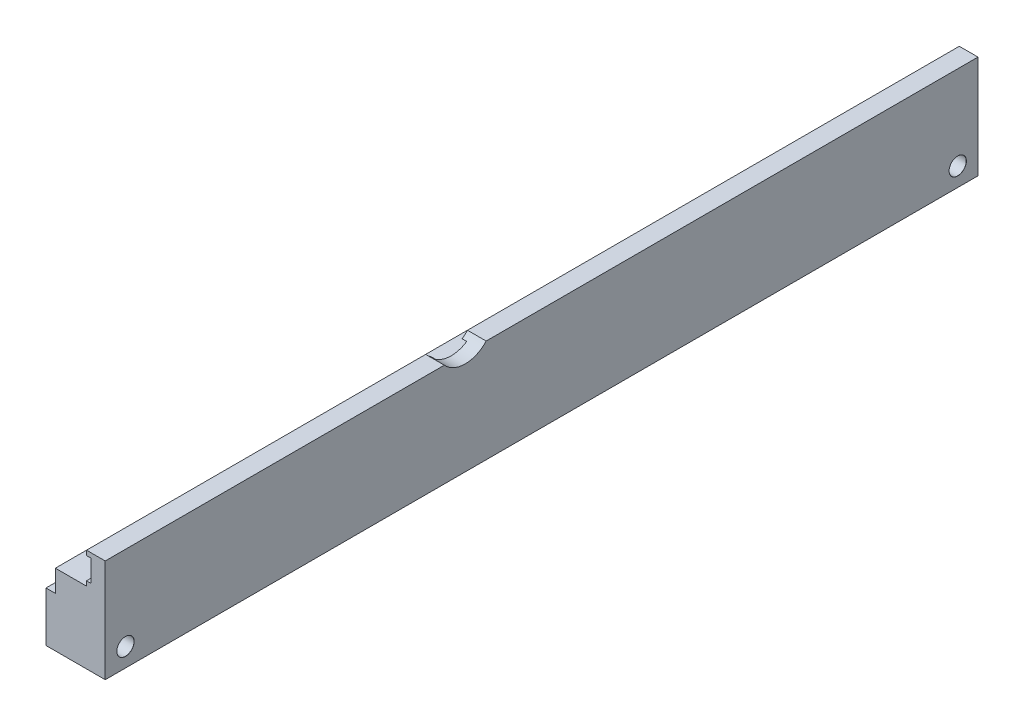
ISO-10303-21;
HEADER;
FILE_DESCRIPTION(('STEP AP214'),'2;1');
FILE_NAME('part.step','',(''),(''),'','','');
FILE_SCHEMA(('AUTOMOTIVE_DESIGN { 1 0 10303 214 1 1 1 1 }'));
ENDSEC;
DATA;
#1=APPLICATION_CONTEXT('core data for automotive mechanical design processes');
#2=APPLICATION_PROTOCOL_DEFINITION('international standard','automotive_design',2000,#1);
#3=PRODUCT_CONTEXT('',#1,'mechanical');
#4=PRODUCT('Part','Part','',(#3));
#5=PRODUCT_RELATED_PRODUCT_CATEGORY('part','',(#4));
#6=PRODUCT_DEFINITION_FORMATION('','',#4);
#7=PRODUCT_DEFINITION_CONTEXT('part definition',#1,'design');
#8=PRODUCT_DEFINITION('design','',#6,#7);
#9=PRODUCT_DEFINITION_SHAPE('','',#8);
#10=(LENGTH_UNIT() NAMED_UNIT(*) SI_UNIT(.MILLI.,.METRE.));
#11=(NAMED_UNIT(*) PLANE_ANGLE_UNIT() SI_UNIT($,.RADIAN.));
#12=(NAMED_UNIT(*) SI_UNIT($,.STERADIAN.) SOLID_ANGLE_UNIT());
#13=UNCERTAINTY_MEASURE_WITH_UNIT(LENGTH_MEASURE(1.E-05),#10,'distance_accuracy_value','');
#14=(GEOMETRIC_REPRESENTATION_CONTEXT(3) GLOBAL_UNCERTAINTY_ASSIGNED_CONTEXT((#13)) GLOBAL_UNIT_ASSIGNED_CONTEXT((#10,
#11,#12)) REPRESENTATION_CONTEXT('',''));
#15=CARTESIAN_POINT('',(0.,0.,0.));
#16=DIRECTION('',(0.,0.,1.));
#17=DIRECTION('',(1.,0.,0.));
#18=AXIS2_PLACEMENT_3D('',#15,#16,#17);
#19=CARTESIAN_POINT('',(-159.,251.054588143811,280.));
#20=DIRECTION('',(0.,-1.,0.));
#21=DIRECTION('',(0.,0.,-1.));
#22=AXIS2_PLACEMENT_3D('',#19,#20,#21);
#23=PLANE('',#22);
#24=DIRECTION('',(0.,0.,-1.));
#25=VECTOR('',#24,1.);
#26=CARTESIAN_POINT('',(-165.,251.054588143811,280.));
#27=LINE('',#26,#25);
#28=CARTESIAN_POINT('',(-165.,251.054588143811,157.791796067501));
#29=VERTEX_POINT('',#28);
#30=CARTESIAN_POINT('',(-165.,251.054588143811,0.));
#31=VERTEX_POINT('',#30);
#32=EDGE_CURVE('E157',#29,#31,#27,.T.);
#33=ORIENTED_EDGE('',*,*,#32,.F.);
#34=DIRECTION('',(1.,0.,0.));
#35=VECTOR('',#34,1.);
#36=CARTESIAN_POINT('',(-178.,251.054588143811,157.791796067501));
#37=LINE('',#36,#35);
#38=CARTESIAN_POINT('',(-159.,251.054588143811,157.791796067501));
#39=VERTEX_POINT('',#38);
#40=EDGE_CURVE('E245',#29,#39,#37,.T.);
#41=ORIENTED_EDGE('',*,*,#40,.T.);
#42=DIRECTION('',(0.,0.,-1.));
#43=VECTOR('',#42,1.);
#44=CARTESIAN_POINT('',(-159.,251.054588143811,280.));
#45=LINE('',#44,#43);
#46=CARTESIAN_POINT('',(-159.,251.054588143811,0.));
#47=VERTEX_POINT('',#46);
#48=EDGE_CURVE('E146',#39,#47,#45,.T.);
#49=ORIENTED_EDGE('',*,*,#48,.T.);
#50=DIRECTION('',(-1.,0.,0.));
#51=VECTOR('',#50,1.);
#52=CARTESIAN_POINT('',(-159.,251.054588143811,0.));
#53=LINE('',#52,#51);
#54=EDGE_CURVE('E173',#47,#31,#53,.T.);
#55=ORIENTED_EDGE('',*,*,#54,.T.);
#56=EDGE_LOOP('',(#33,#41,#49,#55));
#57=FACE_BOUND('',#56,.T.);
#58=ADVANCED_FACE('F16',(#57),#23,.F.);
#59=CARTESIAN_POINT('',(-165.,251.054588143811,280.));
#60=DIRECTION('',(1.,0.,0.));
#61=DIRECTION('',(0.,0.,-1.));
#62=AXIS2_PLACEMENT_3D('',#59,#60,#61);
#63=PLANE('',#62);
#64=CARTESIAN_POINT('',(-165.,251.054588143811,280.));
#65=VERTEX_POINT('',#64);
#66=CARTESIAN_POINT('',(-165.,251.054588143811,171.208203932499));
#67=VERTEX_POINT('',#66);
#68=EDGE_CURVE('E154',#65,#67,#27,.T.);
#69=ORIENTED_EDGE('',*,*,#68,.T.);
#70=CARTESIAN_POINT('',(-165.,257.054588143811,164.5));
#71=DIRECTION('',(1.,0.,0.));
#72=DIRECTION('',(0.,0.,-1.));
#73=AXIS2_PLACEMENT_3D('',#70,#71,#72);
#74=CIRCLE('',#73,9.);
#75=CARTESIAN_POINT('',(-165.,249.55458814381,169.474937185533));
#76=VERTEX_POINT('',#75);
#77=EDGE_CURVE('E133',#67,#76,#74,.T.);
#78=ORIENTED_EDGE('',*,*,#77,.T.);
#79=DIRECTION('',(0.,0.,-1.));
#80=VECTOR('',#79,1.);
#81=CARTESIAN_POINT('',(-165.,249.55458814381,280.));
#82=LINE('',#81,#80);
#83=CARTESIAN_POINT('',(-165.,249.55458814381,280.));
#84=VERTEX_POINT('',#83);
#85=EDGE_CURVE('E187',#84,#76,#82,.T.);
#86=ORIENTED_EDGE('',*,*,#85,.F.);
#87=DIRECTION('',(0.,-1.,0.));
#88=VECTOR('',#87,1.);
#89=CARTESIAN_POINT('',(-165.,251.054588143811,280.));
#90=LINE('',#89,#88);
#91=EDGE_CURVE('E182',#65,#84,#90,.T.);
#92=ORIENTED_EDGE('',*,*,#91,.F.);
#93=EDGE_LOOP('',(#69,#78,#86,#92));
#94=FACE_BOUND('',#93,.T.);
#95=ADVANCED_FACE('F360',(#94),#63,.F.);
#96=CARTESIAN_POINT('',(-163.5,249.55458814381,280.));
#97=DIRECTION('',(0.,1.,0.));
#98=DIRECTION('',(0.,0.,1.));
#99=AXIS2_PLACEMENT_3D('',#96,#97,#98);
#100=PLANE('',#99);
#101=ORIENTED_EDGE('',*,*,#85,.T.);
#102=DIRECTION('',(1.,0.,0.));
#103=VECTOR('',#102,1.);
#104=CARTESIAN_POINT('',(-178.,249.55458814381,169.474937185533));
#105=LINE('',#104,#103);
#106=CARTESIAN_POINT('',(-163.5,249.55458814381,169.474937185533));
#107=VERTEX_POINT('',#106);
#108=EDGE_CURVE('E11',#76,#107,#105,.T.);
#109=ORIENTED_EDGE('',*,*,#108,.T.);
#110=DIRECTION('',(0.,0.,-1.));
#111=VECTOR('',#110,1.);
#112=CARTESIAN_POINT('',(-163.5,249.55458814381,280.));
#113=LINE('',#112,#111);
#114=CARTESIAN_POINT('',(-163.5,249.55458814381,280.));
#115=VERTEX_POINT('',#114);
#116=EDGE_CURVE('E192',#115,#107,#113,.T.);
#117=ORIENTED_EDGE('',*,*,#116,.F.);
#118=DIRECTION('',(1.,0.,0.));
#119=VECTOR('',#118,1.);
#120=CARTESIAN_POINT('',(-163.5,249.55458814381,280.));
#121=LINE('',#120,#119);
#122=EDGE_CURVE('E203',#84,#115,#121,.T.);
#123=ORIENTED_EDGE('',*,*,#122,.F.);
#124=EDGE_LOOP('',(#101,#109,#117,#123));
#125=FACE_BOUND('',#124,.T.);
#126=ADVANCED_FACE('F362',(#125),#100,.F.);
#127=CARTESIAN_POINT('',(-159.,218.05458814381,280.));
#128=DIRECTION('',(-1.,0.,0.));
#129=DIRECTION('',(0.,0.,1.));
#130=AXIS2_PLACEMENT_3D('',#127,#128,#129);
#131=PLANE('',#130);
#132=CARTESIAN_POINT('',(-159.,224.05458814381,6.5));
#133=DIRECTION('',(-1.,0.,0.));
#134=DIRECTION('',(0.,0.,1.));
#135=AXIS2_PLACEMENT_3D('',#132,#133,#134);
#136=CIRCLE('',#135,2.775);
#137=CARTESIAN_POINT('',(-159.,224.05458814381,9.275));
#138=VERTEX_POINT('',#137);
#139=EDGE_CURVE('E288',#138,#138,#136,.T.);
#140=ORIENTED_EDGE('',*,*,#139,.T.);
#141=EDGE_LOOP('',(#140));
#142=FACE_BOUND('',#141,.T.);
#143=CARTESIAN_POINT('',(-159.,224.05458814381,273.5));
#144=DIRECTION('',(-1.,0.,0.));
#145=DIRECTION('',(0.,0.,1.));
#146=AXIS2_PLACEMENT_3D('',#143,#144,#145);
#147=CIRCLE('',#146,2.775);
#148=CARTESIAN_POINT('',(-159.,224.05458814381,276.275));
#149=VERTEX_POINT('',#148);
#150=EDGE_CURVE('E267',#149,#149,#147,.T.);
#151=ORIENTED_EDGE('',*,*,#150,.T.);
#152=EDGE_LOOP('',(#151));
#153=FACE_BOUND('',#152,.T.);
#154=ORIENTED_EDGE('',*,*,#48,.F.);
#155=CARTESIAN_POINT('',(-159.,257.054588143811,164.5));
#156=DIRECTION('',(1.,0.,0.));
#157=DIRECTION('',(0.,0.,-1.));
#158=AXIS2_PLACEMENT_3D('',#155,#156,#157);
#159=CIRCLE('',#158,9.);
#160=CARTESIAN_POINT('',(-159.,251.054588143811,171.208203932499));
#161=VERTEX_POINT('',#160);
#162=EDGE_CURVE('E130',#161,#39,#159,.T.);
#163=ORIENTED_EDGE('',*,*,#162,.F.);
#164=CARTESIAN_POINT('',(-159.,251.054588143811,280.));
#165=VERTEX_POINT('',#164);
#166=EDGE_CURVE('E144',#165,#161,#45,.T.);
#167=ORIENTED_EDGE('',*,*,#166,.F.);
#168=DIRECTION('',(0.,1.,0.));
#169=VECTOR('',#168,1.);
#170=CARTESIAN_POINT('',(-159.,218.05458814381,280.));
#171=LINE('',#170,#169);
#172=CARTESIAN_POINT('',(-159.,218.05458814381,280.));
#173=VERTEX_POINT('',#172);
#174=EDGE_CURVE('E167',#173,#165,#171,.T.);
#175=ORIENTED_EDGE('',*,*,#174,.F.);
#176=DIRECTION('',(0.,0.,-1.));
#177=VECTOR('',#176,1.);
#178=CARTESIAN_POINT('',(-159.,218.05458814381,280.));
#179=LINE('',#178,#177);
#180=CARTESIAN_POINT('',(-159.,218.05458814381,0.));
#181=VERTEX_POINT('',#180);
#182=EDGE_CURVE('E161',#173,#181,#179,.T.);
#183=ORIENTED_EDGE('',*,*,#182,.T.);
#184=DIRECTION('',(0.,1.,0.));
#185=VECTOR('',#184,1.);
#186=CARTESIAN_POINT('',(-159.,218.05458814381,0.));
#187=LINE('',#186,#185);
#188=EDGE_CURVE('E176',#181,#47,#187,.T.);
#189=ORIENTED_EDGE('',*,*,#188,.T.);
#190=EDGE_LOOP('',(#154,#163,#167,#175,#183,#189));
#191=FACE_BOUND('',#190,.T.);
#192=ADVANCED_FACE('F18',(#142,#153,#191),#131,.F.);
#193=ORIENTED_EDGE('',*,*,#166,.T.);
#194=DIRECTION('',(1.,0.,0.));
#195=VECTOR('',#194,1.);
#196=CARTESIAN_POINT('',(-178.,251.054588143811,171.208203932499));
#197=LINE('',#196,#195);
#198=EDGE_CURVE('E127',#161,#67,#197,.F.);
#199=ORIENTED_EDGE('',*,*,#198,.T.);
#200=ORIENTED_EDGE('',*,*,#68,.F.);
#201=DIRECTION('',(-1.,0.,0.));
#202=VECTOR('',#201,1.);
#203=CARTESIAN_POINT('',(-159.,251.054588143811,280.));
#204=LINE('',#203,#202);
#205=EDGE_CURVE('E151',#165,#65,#204,.T.);
#206=ORIENTED_EDGE('',*,*,#205,.F.);
#207=EDGE_LOOP('',(#193,#199,#200,#206));
#208=FACE_BOUND('',#207,.T.);
#209=ADVANCED_FACE('F150',(#208),#23,.F.);
#210=CARTESIAN_POINT('',(-165.,249.55458814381,159.525062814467));
#211=VERTEX_POINT('',#210);
#212=CARTESIAN_POINT('',(-165.,249.55458814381,0.));
#213=VERTEX_POINT('',#212);
#214=EDGE_CURVE('E191',#211,#213,#82,.T.);
#215=ORIENTED_EDGE('',*,*,#214,.F.);
#216=EDGE_CURVE('E31',#211,#29,#74,.T.);
#217=ORIENTED_EDGE('',*,*,#216,.T.);
#218=ORIENTED_EDGE('',*,*,#32,.T.);
#219=DIRECTION('',(0.,-1.,0.));
#220=VECTOR('',#219,1.);
#221=CARTESIAN_POINT('',(-165.,251.054588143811,0.));
#222=LINE('',#221,#220);
#223=EDGE_CURVE('E170',#31,#213,#222,.T.);
#224=ORIENTED_EDGE('',*,*,#223,.T.);
#225=EDGE_LOOP('',(#215,#217,#218,#224));
#226=FACE_BOUND('',#225,.T.);
#227=ADVANCED_FACE('F335',(#226),#63,.F.);
#228=CARTESIAN_POINT('',(-178.,218.05458814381,280.));
#229=DIRECTION('',(1.,0.,0.));
#230=DIRECTION('',(0.,0.,-1.));
#231=AXIS2_PLACEMENT_3D('',#228,#229,#230);
#232=PLANE('',#231);
#233=CARTESIAN_POINT('',(-178.,224.05458814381,6.5));
#234=DIRECTION('',(-1.,0.,0.));
#235=DIRECTION('',(0.,0.,1.));
#236=AXIS2_PLACEMENT_3D('',#233,#234,#235);
#237=CIRCLE('',#236,5.025);
#238=CARTESIAN_POINT('',(-178.,224.05458814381,11.525));
#239=VERTEX_POINT('',#238);
#240=EDGE_CURVE('E285',#239,#239,#237,.T.);
#241=ORIENTED_EDGE('',*,*,#240,.F.);
#242=EDGE_LOOP('',(#241));
#243=FACE_BOUND('',#242,.T.);
#244=CARTESIAN_POINT('',(-178.,224.05458814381,273.5));
#245=DIRECTION('',(-1.,0.,0.));
#246=DIRECTION('',(0.,0.,1.));
#247=AXIS2_PLACEMENT_3D('',#244,#245,#246);
#248=CIRCLE('',#247,5.025);
#249=CARTESIAN_POINT('',(-178.,224.05458814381,278.525));
#250=VERTEX_POINT('',#249);
#251=EDGE_CURVE('E264',#250,#250,#248,.T.);
#252=ORIENTED_EDGE('',*,*,#251,.F.);
#253=EDGE_LOOP('',(#252));
#254=FACE_BOUND('',#253,.T.);
#255=DIRECTION('',(0.,-1.,0.));
#256=VECTOR('',#255,1.);
#257=CARTESIAN_POINT('',(-178.,218.05458814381,280.));
#258=LINE('',#257,#256);
#259=CARTESIAN_POINT('',(-178.,234.05458814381,280.));
#260=VERTEX_POINT('',#259);
#261=CARTESIAN_POINT('',(-178.,218.05458814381,280.));
#262=VERTEX_POINT('',#261);
#263=EDGE_CURVE('E180',#260,#262,#258,.T.);
#264=ORIENTED_EDGE('',*,*,#263,.F.);
#265=DIRECTION('',(0.,0.,-1.));
#266=VECTOR('',#265,1.);
#267=CARTESIAN_POINT('',(-178.,234.05458814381,280.));
#268=LINE('',#267,#266);
#269=CARTESIAN_POINT('',(-178.,234.05458814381,0.));
#270=VERTEX_POINT('',#269);
#271=EDGE_CURVE('E216',#260,#270,#268,.T.);
#272=ORIENTED_EDGE('',*,*,#271,.T.);
#273=DIRECTION('',(0.,-1.,0.));
#274=VECTOR('',#273,1.);
#275=CARTESIAN_POINT('',(-178.,218.05458814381,0.));
#276=LINE('',#275,#274);
#277=CARTESIAN_POINT('',(-178.,218.05458814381,0.));
#278=VERTEX_POINT('',#277);
#279=EDGE_CURVE('E168',#270,#278,#276,.T.);
#280=ORIENTED_EDGE('',*,*,#279,.T.);
#281=DIRECTION('',(0.,0.,-1.));
#282=VECTOR('',#281,1.);
#283=CARTESIAN_POINT('',(-178.,218.05458814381,280.));
#284=LINE('',#283,#282);
#285=EDGE_CURVE('E158',#262,#278,#284,.T.);
#286=ORIENTED_EDGE('',*,*,#285,.F.);
#287=EDGE_LOOP('',(#264,#272,#280,#286));
#288=FACE_BOUND('',#287,.T.);
#289=ADVANCED_FACE('F331',(#243,#254,#288),#232,.F.);
#290=CARTESIAN_POINT('',(-159.,218.05458814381,280.));
#291=DIRECTION('',(0.,1.,0.));
#292=DIRECTION('',(0.,0.,1.));
#293=AXIS2_PLACEMENT_3D('',#290,#291,#292);
#294=PLANE('',#293);
#295=DIRECTION('',(1.,0.,0.));
#296=VECTOR('',#295,1.);
#297=CARTESIAN_POINT('',(-159.,218.05458814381,0.));
#298=LINE('',#297,#296);
#299=EDGE_CURVE('E165',#278,#181,#298,.T.);
#300=ORIENTED_EDGE('',*,*,#299,.T.);
#301=ORIENTED_EDGE('',*,*,#182,.F.);
#302=DIRECTION('',(1.,0.,0.));
#303=VECTOR('',#302,1.);
#304=CARTESIAN_POINT('',(-159.,218.05458814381,280.));
#305=LINE('',#304,#303);
#306=EDGE_CURVE('E164',#262,#173,#305,.T.);
#307=ORIENTED_EDGE('',*,*,#306,.F.);
#308=ORIENTED_EDGE('',*,*,#285,.T.);
#309=EDGE_LOOP('',(#300,#301,#307,#308));
#310=FACE_BOUND('',#309,.T.);
#311=ADVANCED_FACE('F334',(#310),#294,.F.);
#312=CARTESIAN_POINT('',(0.,0.,280.));
#313=DIRECTION('',(0.,0.,1.));
#314=DIRECTION('',(1.,0.,0.));
#315=AXIS2_PLACEMENT_3D('',#312,#313,#314);
#316=PLANE('',#315);
#317=DIRECTION('',(-1.,0.,0.));
#318=VECTOR('',#317,1.);
#319=CARTESIAN_POINT('',(-178.,234.05458814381,280.));
#320=LINE('',#319,#318);
#321=CARTESIAN_POINT('',(-175.,234.05458814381,280.));
#322=VERTEX_POINT('',#321);
#323=EDGE_CURVE('E234',#322,#260,#320,.T.);
#324=ORIENTED_EDGE('',*,*,#323,.T.);
#325=ORIENTED_EDGE('',*,*,#263,.T.);
#326=ORIENTED_EDGE('',*,*,#306,.T.);
#327=ORIENTED_EDGE('',*,*,#174,.T.);
#328=ORIENTED_EDGE('',*,*,#205,.T.);
#329=ORIENTED_EDGE('',*,*,#91,.T.);
#330=ORIENTED_EDGE('',*,*,#122,.T.);
#331=DIRECTION('',(0.,-1.,0.));
#332=VECTOR('',#331,1.);
#333=CARTESIAN_POINT('',(-163.5,242.55458814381,280.));
#334=LINE('',#333,#332);
#335=CARTESIAN_POINT('',(-163.5,242.55458814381,280.));
#336=VERTEX_POINT('',#335);
#337=EDGE_CURVE('E226',#115,#336,#334,.T.);
#338=ORIENTED_EDGE('',*,*,#337,.T.);
#339=DIRECTION('',(-1.,0.,0.));
#340=VECTOR('',#339,1.);
#341=CARTESIAN_POINT('',(-163.5,242.55458814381,280.));
#342=LINE('',#341,#340);
#343=CARTESIAN_POINT('',(-165.,242.55458814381,280.));
#344=VERTEX_POINT('',#343);
#345=EDGE_CURVE('E223',#336,#344,#342,.T.);
#346=ORIENTED_EDGE('',*,*,#345,.T.);
#347=DIRECTION('',(0.,-1.,0.));
#348=VECTOR('',#347,1.);
#349=CARTESIAN_POINT('',(-165.,242.55458814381,280.));
#350=LINE('',#349,#348);
#351=CARTESIAN_POINT('',(-165.,241.05458814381,280.));
#352=VERTEX_POINT('',#351);
#353=EDGE_CURVE('E220',#344,#352,#350,.T.);
#354=ORIENTED_EDGE('',*,*,#353,.T.);
#355=DIRECTION('',(-1.,0.,0.));
#356=VECTOR('',#355,1.);
#357=CARTESIAN_POINT('',(-178.,241.05458814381,280.));
#358=LINE('',#357,#356);
#359=CARTESIAN_POINT('',(-175.,241.05458814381,280.));
#360=VERTEX_POINT('',#359);
#361=EDGE_CURVE('E217',#352,#360,#358,.T.);
#362=ORIENTED_EDGE('',*,*,#361,.T.);
#363=DIRECTION('',(0.,-1.,0.));
#364=VECTOR('',#363,1.);
#365=CARTESIAN_POINT('',(-175.,234.05458814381,280.));
#366=LINE('',#365,#364);
#367=EDGE_CURVE('E39',#360,#322,#366,.T.);
#368=ORIENTED_EDGE('',*,*,#367,.T.);
#369=EDGE_LOOP('',(#324,#325,#326,#327,#328,#329,#330,#338,#346,#354,#362,#368));
#370=FACE_BOUND('',#369,.T.);
#371=ADVANCED_FACE('F344',(#370),#316,.T.);
#372=CARTESIAN_POINT('',(0.,0.,0.));
#373=DIRECTION('',(0.,0.,1.));
#374=DIRECTION('',(1.,0.,0.));
#375=AXIS2_PLACEMENT_3D('',#372,#373,#374);
#376=PLANE('',#375);
#377=ORIENTED_EDGE('',*,*,#279,.F.);
#378=DIRECTION('',(-1.,0.,0.));
#379=VECTOR('',#378,1.);
#380=CARTESIAN_POINT('',(-178.,234.05458814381,0.));
#381=LINE('',#380,#379);
#382=CARTESIAN_POINT('',(-175.,234.05458814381,0.));
#383=VERTEX_POINT('',#382);
#384=EDGE_CURVE('E238',#383,#270,#381,.T.);
#385=ORIENTED_EDGE('',*,*,#384,.F.);
#386=DIRECTION('',(0.,-1.,0.));
#387=VECTOR('',#386,1.);
#388=CARTESIAN_POINT('',(-175.,234.05458814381,0.));
#389=LINE('',#388,#387);
#390=CARTESIAN_POINT('',(-175.,241.05458814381,0.));
#391=VERTEX_POINT('',#390);
#392=EDGE_CURVE('E138',#391,#383,#389,.T.);
#393=ORIENTED_EDGE('',*,*,#392,.F.);
#394=DIRECTION('',(-1.,0.,0.));
#395=VECTOR('',#394,1.);
#396=CARTESIAN_POINT('',(-178.,241.05458814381,0.));
#397=LINE('',#396,#395);
#398=CARTESIAN_POINT('',(-165.,241.05458814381,0.));
#399=VERTEX_POINT('',#398);
#400=EDGE_CURVE('E200',#399,#391,#397,.T.);
#401=ORIENTED_EDGE('',*,*,#400,.F.);
#402=DIRECTION('',(0.,-1.,0.));
#403=VECTOR('',#402,1.);
#404=CARTESIAN_POINT('',(-165.,242.55458814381,0.));
#405=LINE('',#404,#403);
#406=CARTESIAN_POINT('',(-165.,242.55458814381,0.));
#407=VERTEX_POINT('',#406);
#408=EDGE_CURVE('E204',#407,#399,#405,.T.);
#409=ORIENTED_EDGE('',*,*,#408,.F.);
#410=DIRECTION('',(-1.,0.,0.));
#411=VECTOR('',#410,1.);
#412=CARTESIAN_POINT('',(-163.5,242.55458814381,0.));
#413=LINE('',#412,#411);
#414=CARTESIAN_POINT('',(-163.5,242.55458814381,0.));
#415=VERTEX_POINT('',#414);
#416=EDGE_CURVE('E207',#415,#407,#413,.T.);
#417=ORIENTED_EDGE('',*,*,#416,.F.);
#418=DIRECTION('',(0.,-1.,0.));
#419=VECTOR('',#418,1.);
#420=CARTESIAN_POINT('',(-163.5,242.55458814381,0.));
#421=LINE('',#420,#419);
#422=CARTESIAN_POINT('',(-163.5,249.55458814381,0.));
#423=VERTEX_POINT('',#422);
#424=EDGE_CURVE('E210',#423,#415,#421,.T.);
#425=ORIENTED_EDGE('',*,*,#424,.F.);
#426=DIRECTION('',(1.,0.,0.));
#427=VECTOR('',#426,1.);
#428=CARTESIAN_POINT('',(-163.5,249.55458814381,0.));
#429=LINE('',#428,#427);
#430=EDGE_CURVE('E213',#213,#423,#429,.T.);
#431=ORIENTED_EDGE('',*,*,#430,.F.);
#432=ORIENTED_EDGE('',*,*,#223,.F.);
#433=ORIENTED_EDGE('',*,*,#54,.F.);
#434=ORIENTED_EDGE('',*,*,#188,.F.);
#435=ORIENTED_EDGE('',*,*,#299,.F.);
#436=EDGE_LOOP('',(#377,#385,#393,#401,#409,#417,#425,#431,#432,#433,#434,#435));
#437=FACE_BOUND('',#436,.T.);
#438=ADVANCED_FACE('F352',(#437),#376,.F.);
#439=CARTESIAN_POINT('',(-178.,241.05458814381,280.));
#440=DIRECTION('',(0.,-1.,0.));
#441=DIRECTION('',(0.,0.,-1.));
#442=AXIS2_PLACEMENT_3D('',#439,#440,#441);
#443=PLANE('',#442);
#444=ORIENTED_EDGE('',*,*,#400,.T.);
#445=DIRECTION('',(0.,0.,-1.));
#446=VECTOR('',#445,1.);
#447=CARTESIAN_POINT('',(-175.,241.05458814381,280.));
#448=LINE('',#447,#446);
#449=EDGE_CURVE('E231',#360,#391,#448,.T.);
#450=ORIENTED_EDGE('',*,*,#449,.F.);
#451=ORIENTED_EDGE('',*,*,#361,.F.);
#452=DIRECTION('',(0.,0.,-1.));
#453=VECTOR('',#452,1.);
#454=CARTESIAN_POINT('',(-165.,241.05458814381,280.));
#455=LINE('',#454,#453);
#456=EDGE_CURVE('E178',#352,#399,#455,.T.);
#457=ORIENTED_EDGE('',*,*,#456,.T.);
#458=EDGE_LOOP('',(#444,#450,#451,#457));
#459=FACE_BOUND('',#458,.T.);
#460=ADVANCED_FACE('F377',(#459),#443,.F.);
#461=CARTESIAN_POINT('',(-165.,242.55458814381,280.));
#462=DIRECTION('',(1.,0.,0.));
#463=DIRECTION('',(0.,0.,-1.));
#464=AXIS2_PLACEMENT_3D('',#461,#462,#463);
#465=PLANE('',#464);
#466=ORIENTED_EDGE('',*,*,#408,.T.);
#467=ORIENTED_EDGE('',*,*,#456,.F.);
#468=ORIENTED_EDGE('',*,*,#353,.F.);
#469=DIRECTION('',(0.,0.,-1.));
#470=VECTOR('',#469,1.);
#471=CARTESIAN_POINT('',(-165.,242.55458814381,280.));
#472=LINE('',#471,#470);
#473=EDGE_CURVE('E197',#344,#407,#472,.T.);
#474=ORIENTED_EDGE('',*,*,#473,.T.);
#475=EDGE_LOOP('',(#466,#467,#468,#474));
#476=FACE_BOUND('',#475,.T.);
#477=ADVANCED_FACE('F374',(#476),#465,.F.);
#478=CARTESIAN_POINT('',(-163.5,242.55458814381,280.));
#479=DIRECTION('',(0.,-1.,0.));
#480=DIRECTION('',(0.,0.,-1.));
#481=AXIS2_PLACEMENT_3D('',#478,#479,#480);
#482=PLANE('',#481);
#483=ORIENTED_EDGE('',*,*,#416,.T.);
#484=ORIENTED_EDGE('',*,*,#473,.F.);
#485=ORIENTED_EDGE('',*,*,#345,.F.);
#486=DIRECTION('',(0.,0.,-1.));
#487=VECTOR('',#486,1.);
#488=CARTESIAN_POINT('',(-163.5,242.55458814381,280.));
#489=LINE('',#488,#487);
#490=EDGE_CURVE('E195',#336,#415,#489,.T.);
#491=ORIENTED_EDGE('',*,*,#490,.T.);
#492=EDGE_LOOP('',(#483,#484,#485,#491));
#493=FACE_BOUND('',#492,.T.);
#494=ADVANCED_FACE('F370',(#493),#482,.F.);
#495=CARTESIAN_POINT('',(-163.5,242.55458814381,280.));
#496=DIRECTION('',(1.,0.,0.));
#497=DIRECTION('',(0.,0.,-1.));
#498=AXIS2_PLACEMENT_3D('',#495,#496,#497);
#499=PLANE('',#498);
#500=ORIENTED_EDGE('',*,*,#116,.T.);
#501=CARTESIAN_POINT('',(-163.5,257.054588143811,164.5));
#502=DIRECTION('',(1.,0.,0.));
#503=DIRECTION('',(0.,0.,-1.));
#504=AXIS2_PLACEMENT_3D('',#501,#502,#503);
#505=CIRCLE('',#504,9.);
#506=CARTESIAN_POINT('',(-163.5,249.55458814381,159.525062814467));
#507=VERTEX_POINT('',#506);
#508=EDGE_CURVE('E147',#107,#507,#505,.T.);
#509=ORIENTED_EDGE('',*,*,#508,.T.);
#510=EDGE_CURVE('E190',#507,#423,#113,.T.);
#511=ORIENTED_EDGE('',*,*,#510,.T.);
#512=ORIENTED_EDGE('',*,*,#424,.T.);
#513=ORIENTED_EDGE('',*,*,#490,.F.);
#514=ORIENTED_EDGE('',*,*,#337,.F.);
#515=EDGE_LOOP('',(#500,#509,#511,#512,#513,#514));
#516=FACE_BOUND('',#515,.T.);
#517=ADVANCED_FACE('F366',(#516),#499,.F.);
#518=ORIENTED_EDGE('',*,*,#510,.F.);
#519=DIRECTION('',(1.,0.,0.));
#520=VECTOR('',#519,1.);
#521=CARTESIAN_POINT('',(-178.,249.55458814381,159.525062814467));
#522=LINE('',#521,#520);
#523=EDGE_CURVE('E24',#507,#211,#522,.F.);
#524=ORIENTED_EDGE('',*,*,#523,.T.);
#525=ORIENTED_EDGE('',*,*,#214,.T.);
#526=ORIENTED_EDGE('',*,*,#430,.T.);
#527=EDGE_LOOP('',(#518,#524,#525,#526));
#528=FACE_BOUND('',#527,.T.);
#529=ADVANCED_FACE('F389',(#528),#100,.F.);
#530=CARTESIAN_POINT('',(-178.,234.05458814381,280.));
#531=DIRECTION('',(0.,-1.,0.));
#532=DIRECTION('',(0.,0.,-1.));
#533=AXIS2_PLACEMENT_3D('',#530,#531,#532);
#534=PLANE('',#533);
#535=ORIENTED_EDGE('',*,*,#384,.T.);
#536=ORIENTED_EDGE('',*,*,#271,.F.);
#537=ORIENTED_EDGE('',*,*,#323,.F.);
#538=DIRECTION('',(0.,0.,-1.));
#539=VECTOR('',#538,1.);
#540=CARTESIAN_POINT('',(-175.,234.05458814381,280.));
#541=LINE('',#540,#539);
#542=EDGE_CURVE('E233',#322,#383,#541,.T.);
#543=ORIENTED_EDGE('',*,*,#542,.T.);
#544=EDGE_LOOP('',(#535,#536,#537,#543));
#545=FACE_BOUND('',#544,.T.);
#546=ADVANCED_FACE('F348',(#545),#534,.F.);
#547=CARTESIAN_POINT('',(-175.,234.05458814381,280.));
#548=DIRECTION('',(1.,0.,0.));
#549=DIRECTION('',(0.,0.,-1.));
#550=AXIS2_PLACEMENT_3D('',#547,#548,#549);
#551=PLANE('',#550);
#552=ORIENTED_EDGE('',*,*,#392,.T.);
#553=ORIENTED_EDGE('',*,*,#542,.F.);
#554=ORIENTED_EDGE('',*,*,#367,.F.);
#555=ORIENTED_EDGE('',*,*,#449,.T.);
#556=EDGE_LOOP('',(#552,#553,#554,#555));
#557=FACE_BOUND('',#556,.T.);
#558=ADVANCED_FACE('F378',(#557),#551,.F.);
#559=CARTESIAN_POINT('',(-178.,257.054588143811,164.5));
#560=DIRECTION('',(1.,0.,0.));
#561=DIRECTION('',(0.,0.,-1.));
#562=AXIS2_PLACEMENT_3D('',#559,#560,#561);
#563=CYLINDRICAL_SURFACE('',#562,9.);
#564=ORIENTED_EDGE('',*,*,#162,.T.);
#565=ORIENTED_EDGE('',*,*,#40,.F.);
#566=ORIENTED_EDGE('',*,*,#216,.F.);
#567=ORIENTED_EDGE('',*,*,#523,.F.);
#568=ORIENTED_EDGE('',*,*,#508,.F.);
#569=ORIENTED_EDGE('',*,*,#108,.F.);
#570=ORIENTED_EDGE('',*,*,#77,.F.);
#571=ORIENTED_EDGE('',*,*,#198,.F.);
#572=EDGE_LOOP('',(#564,#565,#566,#567,#568,#569,#570,#571));
#573=FACE_BOUND('',#572,.T.);
#574=ADVANCED_FACE('F129',(#573),#563,.F.);
#575=CARTESIAN_POINT('',(-159.025,224.05458814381,273.5));
#576=DIRECTION('',(1.,0.,0.));
#577=DIRECTION('',(0.,0.,-1.));
#578=AXIS2_PLACEMENT_3D('',#575,#576,#577);
#579=CONICAL_SURFACE('',#578,2.75,0.785398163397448);
#580=ORIENTED_EDGE('',*,*,#150,.F.);
#581=EDGE_LOOP('',(#580));
#582=FACE_BOUND('',#581,.T.);
#583=CARTESIAN_POINT('',(-159.025,224.05458814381,273.5));
#584=DIRECTION('',(-1.,0.,0.));
#585=DIRECTION('',(0.,0.,1.));
#586=AXIS2_PLACEMENT_3D('',#583,#584,#585);
#587=CIRCLE('',#586,2.75);
#588=CARTESIAN_POINT('',(-159.025,224.05458814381,276.25));
#589=VERTEX_POINT('',#588);
#590=EDGE_CURVE('E148',#589,#589,#587,.T.);
#591=ORIENTED_EDGE('',*,*,#590,.T.);
#592=EDGE_LOOP('',(#591));
#593=FACE_BOUND('',#592,.T.);
#594=ADVANCED_FACE('F387',(#582,#593),#579,.F.);
#595=CARTESIAN_POINT('',(-178.,224.05458814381,273.5));
#596=DIRECTION('',(-1.,0.,0.));
#597=DIRECTION('',(0.,0.,1.));
#598=AXIS2_PLACEMENT_3D('',#595,#596,#597);
#599=CYLINDRICAL_SURFACE('',#598,2.75);
#600=ORIENTED_EDGE('',*,*,#590,.F.);
#601=EDGE_LOOP('',(#600));
#602=FACE_BOUND('',#601,.T.);
#603=CARTESIAN_POINT('',(-172.275,224.05458814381,273.5));
#604=DIRECTION('',(-1.,0.,0.));
#605=DIRECTION('',(0.,0.,1.));
#606=AXIS2_PLACEMENT_3D('',#603,#604,#605);
#607=CIRCLE('',#606,2.75);
#608=CARTESIAN_POINT('',(-172.275,224.05458814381,276.25));
#609=VERTEX_POINT('',#608);
#610=EDGE_CURVE('E252',#609,#609,#607,.T.);
#611=ORIENTED_EDGE('',*,*,#610,.T.);
#612=EDGE_LOOP('',(#611));
#613=FACE_BOUND('',#612,.T.);
#614=ADVANCED_FACE('F513',(#602,#613),#599,.F.);
#615=CARTESIAN_POINT('',(-172.3,224.05458814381,273.5));
#616=DIRECTION('',(-1.,0.,0.));
#617=DIRECTION('',(0.,0.,1.));
#618=AXIS2_PLACEMENT_3D('',#615,#616,#617);
#619=CONICAL_SURFACE('',#618,2.775,0.785398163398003);
#620=ORIENTED_EDGE('',*,*,#610,.F.);
#621=EDGE_LOOP('',(#620));
#622=FACE_BOUND('',#621,.T.);
#623=CARTESIAN_POINT('',(-172.3,224.05458814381,273.5));
#624=DIRECTION('',(-1.,0.,0.));
#625=DIRECTION('',(0.,0.,1.));
#626=AXIS2_PLACEMENT_3D('',#623,#624,#625);
#627=CIRCLE('',#626,2.775);
#628=CARTESIAN_POINT('',(-172.3,224.05458814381,276.275));
#629=VERTEX_POINT('',#628);
#630=EDGE_CURVE('E255',#629,#629,#627,.T.);
#631=ORIENTED_EDGE('',*,*,#630,.T.);
#632=EDGE_LOOP('',(#631));
#633=FACE_BOUND('',#632,.T.);
#634=ADVANCED_FACE('F523',(#622,#633),#619,.F.);
#635=CARTESIAN_POINT('',(-172.3,226.82958814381,273.5));
#636=DIRECTION('',(1.,0.,0.));
#637=DIRECTION('',(0.,0.,-1.));
#638=AXIS2_PLACEMENT_3D('',#635,#636,#637);
#639=PLANE('',#638);
#640=ORIENTED_EDGE('',*,*,#630,.F.);
#641=EDGE_LOOP('',(#640));
#642=FACE_BOUND('',#641,.T.);
#643=CARTESIAN_POINT('',(-172.3,224.05458814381,273.5));
#644=DIRECTION('',(-1.,0.,0.));
#645=DIRECTION('',(0.,0.,1.));
#646=AXIS2_PLACEMENT_3D('',#643,#644,#645);
#647=CIRCLE('',#646,5.);
#648=CARTESIAN_POINT('',(-172.3,224.05458814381,278.5));
#649=VERTEX_POINT('',#648);
#650=EDGE_CURVE('E258',#649,#649,#647,.T.);
#651=ORIENTED_EDGE('',*,*,#650,.T.);
#652=EDGE_LOOP('',(#651));
#653=FACE_BOUND('',#652,.T.);
#654=ADVANCED_FACE('F533',(#642,#653),#639,.F.);
#655=CARTESIAN_POINT('',(-178.,224.05458814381,273.5));
#656=DIRECTION('',(-1.,0.,0.));
#657=DIRECTION('',(0.,0.,1.));
#658=AXIS2_PLACEMENT_3D('',#655,#656,#657);
#659=CYLINDRICAL_SURFACE('',#658,5.);
#660=ORIENTED_EDGE('',*,*,#650,.F.);
#661=EDGE_LOOP('',(#660));
#662=FACE_BOUND('',#661,.T.);
#663=CARTESIAN_POINT('',(-177.975,224.05458814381,273.5));
#664=DIRECTION('',(-1.,0.,0.));
#665=DIRECTION('',(0.,0.,1.));
#666=AXIS2_PLACEMENT_3D('',#663,#664,#665);
#667=CIRCLE('',#666,5.);
#668=CARTESIAN_POINT('',(-177.975,224.05458814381,278.5));
#669=VERTEX_POINT('',#668);
#670=EDGE_CURVE('E261',#669,#669,#667,.T.);
#671=ORIENTED_EDGE('',*,*,#670,.T.);
#672=EDGE_LOOP('',(#671));
#673=FACE_BOUND('',#672,.T.);
#674=ADVANCED_FACE('F543',(#662,#673),#659,.F.);
#675=CARTESIAN_POINT('',(-178.,224.05458814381,273.5));
#676=DIRECTION('',(-1.,0.,0.));
#677=DIRECTION('',(0.,0.,1.));
#678=AXIS2_PLACEMENT_3D('',#675,#676,#677);
#679=CONICAL_SURFACE('',#678,5.025,0.785398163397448);
#680=ORIENTED_EDGE('',*,*,#670,.F.);
#681=EDGE_LOOP('',(#680));
#682=FACE_BOUND('',#681,.T.);
#683=ORIENTED_EDGE('',*,*,#251,.T.);
#684=EDGE_LOOP('',(#683));
#685=FACE_BOUND('',#684,.T.);
#686=ADVANCED_FACE('F298',(#682,#685),#679,.F.);
#687=CARTESIAN_POINT('',(-159.025,224.05458814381,6.5));
#688=DIRECTION('',(1.,0.,0.));
#689=DIRECTION('',(0.,0.,-1.));
#690=AXIS2_PLACEMENT_3D('',#687,#688,#689);
#691=CONICAL_SURFACE('',#690,2.75,0.785398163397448);
#692=ORIENTED_EDGE('',*,*,#139,.F.);
#693=EDGE_LOOP('',(#692));
#694=FACE_BOUND('',#693,.T.);
#695=CARTESIAN_POINT('',(-159.025,224.05458814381,6.5));
#696=DIRECTION('',(-1.,0.,0.));
#697=DIRECTION('',(0.,0.,1.));
#698=AXIS2_PLACEMENT_3D('',#695,#696,#697);
#699=CIRCLE('',#698,2.75);
#700=CARTESIAN_POINT('',(-159.025,224.05458814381,9.25));
#701=VERTEX_POINT('',#700);
#702=EDGE_CURVE('E270',#701,#701,#699,.T.);
#703=ORIENTED_EDGE('',*,*,#702,.T.);
#704=EDGE_LOOP('',(#703));
#705=FACE_BOUND('',#704,.T.);
#706=ADVANCED_FACE('F294',(#694,#705),#691,.F.);
#707=CARTESIAN_POINT('',(-178.,224.05458814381,6.5));
#708=DIRECTION('',(-1.,0.,0.));
#709=DIRECTION('',(0.,0.,1.));
#710=AXIS2_PLACEMENT_3D('',#707,#708,#709);
#711=CYLINDRICAL_SURFACE('',#710,2.75);
#712=ORIENTED_EDGE('',*,*,#702,.F.);
#713=EDGE_LOOP('',(#712));
#714=FACE_BOUND('',#713,.T.);
#715=CARTESIAN_POINT('',(-172.275,224.05458814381,6.5));
#716=DIRECTION('',(-1.,0.,0.));
#717=DIRECTION('',(0.,0.,1.));
#718=AXIS2_PLACEMENT_3D('',#715,#716,#717);
#719=CIRCLE('',#718,2.75);
#720=CARTESIAN_POINT('',(-172.275,224.05458814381,9.25));
#721=VERTEX_POINT('',#720);
#722=EDGE_CURVE('E273',#721,#721,#719,.T.);
#723=ORIENTED_EDGE('',*,*,#722,.T.);
#724=EDGE_LOOP('',(#723));
#725=FACE_BOUND('',#724,.T.);
#726=ADVANCED_FACE('F297',(#714,#725),#711,.F.);
#727=CARTESIAN_POINT('',(-172.3,224.05458814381,6.5));
#728=DIRECTION('',(-1.,0.,0.));
#729=DIRECTION('',(0.,0.,1.));
#730=AXIS2_PLACEMENT_3D('',#727,#728,#729);
#731=CONICAL_SURFACE('',#730,2.775,0.785398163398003);
#732=ORIENTED_EDGE('',*,*,#722,.F.);
#733=EDGE_LOOP('',(#732));
#734=FACE_BOUND('',#733,.T.);
#735=CARTESIAN_POINT('',(-172.3,224.05458814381,6.5));
#736=DIRECTION('',(-1.,0.,0.));
#737=DIRECTION('',(0.,0.,1.));
#738=AXIS2_PLACEMENT_3D('',#735,#736,#737);
#739=CIRCLE('',#738,2.775);
#740=CARTESIAN_POINT('',(-172.3,224.05458814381,9.275));
#741=VERTEX_POINT('',#740);
#742=EDGE_CURVE('E276',#741,#741,#739,.T.);
#743=ORIENTED_EDGE('',*,*,#742,.T.);
#744=EDGE_LOOP('',(#743));
#745=FACE_BOUND('',#744,.T.);
#746=ADVANCED_FACE('F304',(#734,#745),#731,.F.);
#747=CARTESIAN_POINT('',(-172.3,226.82958814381,6.5));
#748=DIRECTION('',(1.,0.,0.));
#749=DIRECTION('',(0.,0.,-1.));
#750=AXIS2_PLACEMENT_3D('',#747,#748,#749);
#751=PLANE('',#750);
#752=ORIENTED_EDGE('',*,*,#742,.F.);
#753=EDGE_LOOP('',(#752));
#754=FACE_BOUND('',#753,.T.);
#755=CARTESIAN_POINT('',(-172.3,224.05458814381,6.5));
#756=DIRECTION('',(-1.,0.,0.));
#757=DIRECTION('',(0.,0.,1.));
#758=AXIS2_PLACEMENT_3D('',#755,#756,#757);
#759=CIRCLE('',#758,5.);
#760=CARTESIAN_POINT('',(-172.3,224.05458814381,11.5));
#761=VERTEX_POINT('',#760);
#762=EDGE_CURVE('E279',#761,#761,#759,.T.);
#763=ORIENTED_EDGE('',*,*,#762,.T.);
#764=EDGE_LOOP('',(#763));
#765=FACE_BOUND('',#764,.T.);
#766=ADVANCED_FACE('F310',(#754,#765),#751,.F.);
#767=CARTESIAN_POINT('',(-178.,224.05458814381,6.5));
#768=DIRECTION('',(-1.,0.,0.));
#769=DIRECTION('',(0.,0.,1.));
#770=AXIS2_PLACEMENT_3D('',#767,#768,#769);
#771=CYLINDRICAL_SURFACE('',#770,5.);
#772=ORIENTED_EDGE('',*,*,#762,.F.);
#773=EDGE_LOOP('',(#772));
#774=FACE_BOUND('',#773,.T.);
#775=CARTESIAN_POINT('',(-177.975,224.05458814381,6.5));
#776=DIRECTION('',(-1.,0.,0.));
#777=DIRECTION('',(0.,0.,1.));
#778=AXIS2_PLACEMENT_3D('',#775,#776,#777);
#779=CIRCLE('',#778,5.);
#780=CARTESIAN_POINT('',(-177.975,224.05458814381,11.5));
#781=VERTEX_POINT('',#780);
#782=EDGE_CURVE('E282',#781,#781,#779,.T.);
#783=ORIENTED_EDGE('',*,*,#782,.T.);
#784=EDGE_LOOP('',(#783));
#785=FACE_BOUND('',#784,.T.);
#786=ADVANCED_FACE('F316',(#774,#785),#771,.F.);
#787=CARTESIAN_POINT('',(-178.,224.05458814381,6.5));
#788=DIRECTION('',(-1.,0.,0.));
#789=DIRECTION('',(0.,0.,1.));
#790=AXIS2_PLACEMENT_3D('',#787,#788,#789);
#791=CONICAL_SURFACE('',#790,5.025,0.785398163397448);
#792=ORIENTED_EDGE('',*,*,#782,.F.);
#793=EDGE_LOOP('',(#792));
#794=FACE_BOUND('',#793,.T.);
#795=ORIENTED_EDGE('',*,*,#240,.T.);
#796=EDGE_LOOP('',(#795));
#797=FACE_BOUND('',#796,.T.);
#798=ADVANCED_FACE('F322',(#794,#797),#791,.F.);
#799=CLOSED_SHELL('',(#58,#95,#126,#192,#209,#227,#289,#311,#371,#438,#460,#477,#494,#517,#529,
#546,#558,#574,#594,#614,#634,#654,#674,#686,#706,#726,#746,#766,#786,#798));
#800=MANIFOLD_SOLID_BREP('B1',#799);
#801=ADVANCED_BREP_SHAPE_REPRESENTATION('',(#18,#800),#14);
#802=SHAPE_DEFINITION_REPRESENTATION(#9,#801);
ENDSEC;
END-ISO-10303-21;
